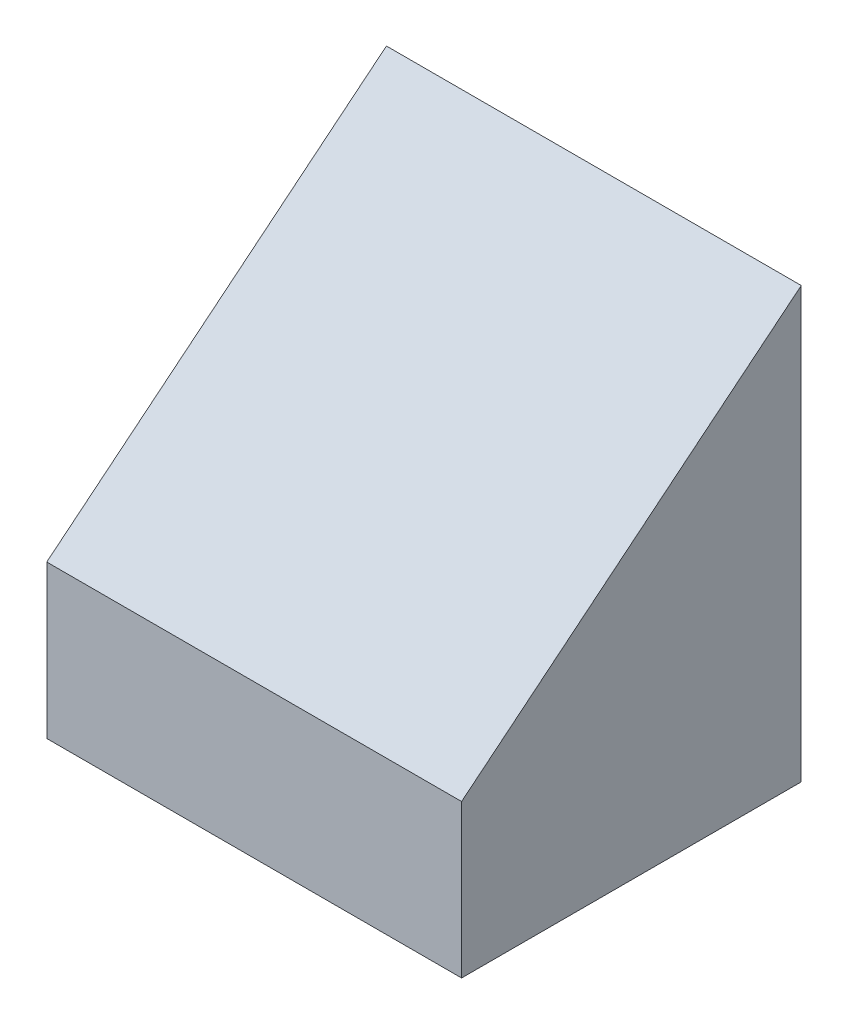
ISO-10303-21;
HEADER;
FILE_DESCRIPTION(('STEP AP214'),'2;1');
FILE_NAME('part.step','',(''),(''),'','','');
FILE_SCHEMA(('AUTOMOTIVE_DESIGN { 1 0 10303 214 1 1 1 1 }'));
ENDSEC;
DATA;
#1=APPLICATION_CONTEXT('core data for automotive mechanical design processes');
#2=APPLICATION_PROTOCOL_DEFINITION('international standard','automotive_design',2000,#1);
#3=PRODUCT_CONTEXT('',#1,'mechanical');
#4=PRODUCT('Part','Part','',(#3));
#5=PRODUCT_RELATED_PRODUCT_CATEGORY('part','',(#4));
#6=PRODUCT_DEFINITION_FORMATION('','',#4);
#7=PRODUCT_DEFINITION_CONTEXT('part definition',#1,'design');
#8=PRODUCT_DEFINITION('design','',#6,#7);
#9=PRODUCT_DEFINITION_SHAPE('','',#8);
#10=(LENGTH_UNIT() NAMED_UNIT(*) SI_UNIT(.MILLI.,.METRE.));
#11=(NAMED_UNIT(*) PLANE_ANGLE_UNIT() SI_UNIT($,.RADIAN.));
#12=(NAMED_UNIT(*) SI_UNIT($,.STERADIAN.) SOLID_ANGLE_UNIT());
#13=UNCERTAINTY_MEASURE_WITH_UNIT(LENGTH_MEASURE(1.E-05),#10,'distance_accuracy_value','');
#14=(GEOMETRIC_REPRESENTATION_CONTEXT(3) GLOBAL_UNCERTAINTY_ASSIGNED_CONTEXT((#13)) GLOBAL_UNIT_ASSIGNED_CONTEXT((#10,
#11,#12)) REPRESENTATION_CONTEXT('',''));
#15=CARTESIAN_POINT('',(0.,0.,0.));
#16=DIRECTION('',(0.,0.,1.));
#17=DIRECTION('',(1.,0.,0.));
#18=AXIS2_PLACEMENT_3D('',#15,#16,#17);
#19=CARTESIAN_POINT('',(92.964,68.5013105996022,0.));
#20=DIRECTION('',(0.,0.,-1.));
#21=DIRECTION('',(-1.,0.,0.));
#22=AXIS2_PLACEMENT_3D('',#19,#20,#21);
#23=PLANE('',#22);
#24=DIRECTION('',(0.,-1.,0.));
#25=VECTOR('',#24,1.);
#26=CARTESIAN_POINT('',(-92.964,68.5013105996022,0.));
#27=LINE('',#26,#25);
#28=CARTESIAN_POINT('',(-92.964,68.5013105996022,0.));
#29=VERTEX_POINT('',#28);
#30=CARTESIAN_POINT('',(-92.964,0.,0.));
#31=VERTEX_POINT('',#30);
#32=EDGE_CURVE('E94',#29,#31,#27,.T.);
#33=ORIENTED_EDGE('',*,*,#32,.T.);
#34=DIRECTION('',(-1.,0.,0.));
#35=VECTOR('',#34,1.);
#36=CARTESIAN_POINT('',(92.964,0.,0.));
#37=LINE('',#36,#35);
#38=CARTESIAN_POINT('',(92.964,0.,0.));
#39=VERTEX_POINT('',#38);
#40=EDGE_CURVE('E11',#39,#31,#37,.T.);
#41=ORIENTED_EDGE('',*,*,#40,.F.);
#42=DIRECTION('',(0.,-1.,0.));
#43=VECTOR('',#42,1.);
#44=CARTESIAN_POINT('',(92.964,68.5013105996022,0.));
#45=LINE('',#44,#43);
#46=CARTESIAN_POINT('',(92.964,68.5013105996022,0.));
#47=VERTEX_POINT('',#46);
#48=EDGE_CURVE('E82',#47,#39,#45,.T.);
#49=ORIENTED_EDGE('',*,*,#48,.F.);
#50=DIRECTION('',(-1.,0.,0.));
#51=VECTOR('',#50,1.);
#52=CARTESIAN_POINT('',(92.964,68.5013105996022,0.));
#53=LINE('',#52,#51);
#54=EDGE_CURVE('E90',#47,#29,#53,.T.);
#55=ORIENTED_EDGE('',*,*,#54,.T.);
#56=EDGE_LOOP('',(#33,#41,#49,#55));
#57=FACE_BOUND('',#56,.T.);
#58=ADVANCED_FACE('F31',(#57),#23,.F.);
#59=CARTESIAN_POINT('',(92.964,0.,0.));
#60=DIRECTION('',(0.,1.,0.));
#61=DIRECTION('',(0.,0.,1.));
#62=AXIS2_PLACEMENT_3D('',#59,#60,#61);
#63=PLANE('',#62);
#64=DIRECTION('',(0.,0.,-1.));
#65=VECTOR('',#64,1.);
#66=CARTESIAN_POINT('',(-92.964,0.,0.));
#67=LINE('',#66,#65);
#68=CARTESIAN_POINT('',(-92.964,0.,-152.236373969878));
#69=VERTEX_POINT('',#68);
#70=EDGE_CURVE('E86',#31,#69,#67,.T.);
#71=ORIENTED_EDGE('',*,*,#70,.T.);
#72=DIRECTION('',(-1.,0.,0.));
#73=VECTOR('',#72,1.);
#74=CARTESIAN_POINT('',(92.964,0.,-152.236373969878));
#75=LINE('',#74,#73);
#76=CARTESIAN_POINT('',(92.964,0.,-152.236373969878));
#77=VERTEX_POINT('',#76);
#78=EDGE_CURVE('E39',#77,#69,#75,.T.);
#79=ORIENTED_EDGE('',*,*,#78,.F.);
#80=DIRECTION('',(0.,0.,-1.));
#81=VECTOR('',#80,1.);
#82=CARTESIAN_POINT('',(92.964,0.,0.));
#83=LINE('',#82,#81);
#84=EDGE_CURVE('E77',#39,#77,#83,.T.);
#85=ORIENTED_EDGE('',*,*,#84,.F.);
#86=ORIENTED_EDGE('',*,*,#40,.T.);
#87=EDGE_LOOP('',(#71,#79,#85,#86));
#88=FACE_BOUND('',#87,.T.);
#89=ADVANCED_FACE('F85',(#88),#63,.F.);
#90=CARTESIAN_POINT('',(92.964,0.,-152.236373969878));
#91=DIRECTION('',(0.,0.,1.));
#92=DIRECTION('',(1.,0.,0.));
#93=AXIS2_PLACEMENT_3D('',#90,#91,#92);
#94=PLANE('',#93);
#95=DIRECTION('',(0.,1.,0.));
#96=VECTOR('',#95,1.);
#97=CARTESIAN_POINT('',(-92.964,0.,-152.236373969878));
#98=LINE('',#97,#96);
#99=CARTESIAN_POINT('',(-92.964,192.677637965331,-152.236373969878));
#100=VERTEX_POINT('',#99);
#101=EDGE_CURVE('E64',#69,#100,#98,.T.);
#102=ORIENTED_EDGE('',*,*,#101,.T.);
#103=DIRECTION('',(-1.,0.,0.));
#104=VECTOR('',#103,1.);
#105=CARTESIAN_POINT('',(92.964,192.677637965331,-152.236373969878));
#106=LINE('',#105,#104);
#107=CARTESIAN_POINT('',(92.964,192.677637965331,-152.236373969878));
#108=VERTEX_POINT('',#107);
#109=EDGE_CURVE('E87',#108,#100,#106,.T.);
#110=ORIENTED_EDGE('',*,*,#109,.F.);
#111=DIRECTION('',(0.,1.,0.));
#112=VECTOR('',#111,1.);
#113=CARTESIAN_POINT('',(92.964,0.,-152.236373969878));
#114=LINE('',#113,#112);
#115=EDGE_CURVE('E80',#77,#108,#114,.T.);
#116=ORIENTED_EDGE('',*,*,#115,.F.);
#117=ORIENTED_EDGE('',*,*,#78,.T.);
#118=EDGE_LOOP('',(#102,#110,#116,#117));
#119=FACE_BOUND('',#118,.T.);
#120=ADVANCED_FACE('F88',(#119),#94,.F.);
#121=CARTESIAN_POINT('',(92.964,192.677637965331,-152.236373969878));
#122=DIRECTION('',(0.,-0.774906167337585,-0.632076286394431));
#123=DIRECTION('',(0.,0.632076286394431,-0.774906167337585));
#124=AXIS2_PLACEMENT_3D('',#121,#122,#123);
#125=PLANE('',#124);
#126=DIRECTION('',(0.,-0.632076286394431,0.774906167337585));
#127=VECTOR('',#126,1.);
#128=CARTESIAN_POINT('',(-92.964,192.677637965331,-152.236373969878));
#129=LINE('',#128,#127);
#130=EDGE_CURVE('E70',#100,#29,#129,.T.);
#131=ORIENTED_EDGE('',*,*,#130,.T.);
#132=ORIENTED_EDGE('',*,*,#54,.F.);
#133=DIRECTION('',(0.,-0.632076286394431,0.774906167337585));
#134=VECTOR('',#133,1.);
#135=CARTESIAN_POINT('',(92.964,192.677637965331,-152.236373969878));
#136=LINE('',#135,#134);
#137=EDGE_CURVE('E47',#108,#47,#136,.T.);
#138=ORIENTED_EDGE('',*,*,#137,.F.);
#139=ORIENTED_EDGE('',*,*,#109,.T.);
#140=EDGE_LOOP('',(#131,#132,#138,#139));
#141=FACE_BOUND('',#140,.T.);
#142=ADVANCED_FACE('F101',(#141),#125,.F.);
#143=CARTESIAN_POINT('',(92.964,0.,0.));
#144=DIRECTION('',(1.,0.,0.));
#145=DIRECTION('',(0.,0.,-1.));
#146=AXIS2_PLACEMENT_3D('',#143,#144,#145);
#147=PLANE('',#146);
#148=ORIENTED_EDGE('',*,*,#48,.T.);
#149=ORIENTED_EDGE('',*,*,#84,.T.);
#150=ORIENTED_EDGE('',*,*,#115,.T.);
#151=ORIENTED_EDGE('',*,*,#137,.T.);
#152=EDGE_LOOP('',(#148,#149,#150,#151));
#153=FACE_BOUND('',#152,.T.);
#154=ADVANCED_FACE('F78',(#153),#147,.T.);
#155=CARTESIAN_POINT('',(-92.964,0.,0.));
#156=DIRECTION('',(1.,0.,0.));
#157=DIRECTION('',(0.,0.,-1.));
#158=AXIS2_PLACEMENT_3D('',#155,#156,#157);
#159=PLANE('',#158);
#160=ORIENTED_EDGE('',*,*,#32,.F.);
#161=ORIENTED_EDGE('',*,*,#130,.F.);
#162=ORIENTED_EDGE('',*,*,#101,.F.);
#163=ORIENTED_EDGE('',*,*,#70,.F.);
#164=EDGE_LOOP('',(#160,#161,#162,#163));
#165=FACE_BOUND('',#164,.T.);
#166=ADVANCED_FACE('F104',(#165),#159,.F.);
#167=CLOSED_SHELL('',(#58,#89,#120,#142,#154,#166));
#168=MANIFOLD_SOLID_BREP('B2',#167);
#169=ADVANCED_BREP_SHAPE_REPRESENTATION('',(#18,#168),#14);
#170=SHAPE_DEFINITION_REPRESENTATION(#9,#169);
ENDSEC;
END-ISO-10303-21;
